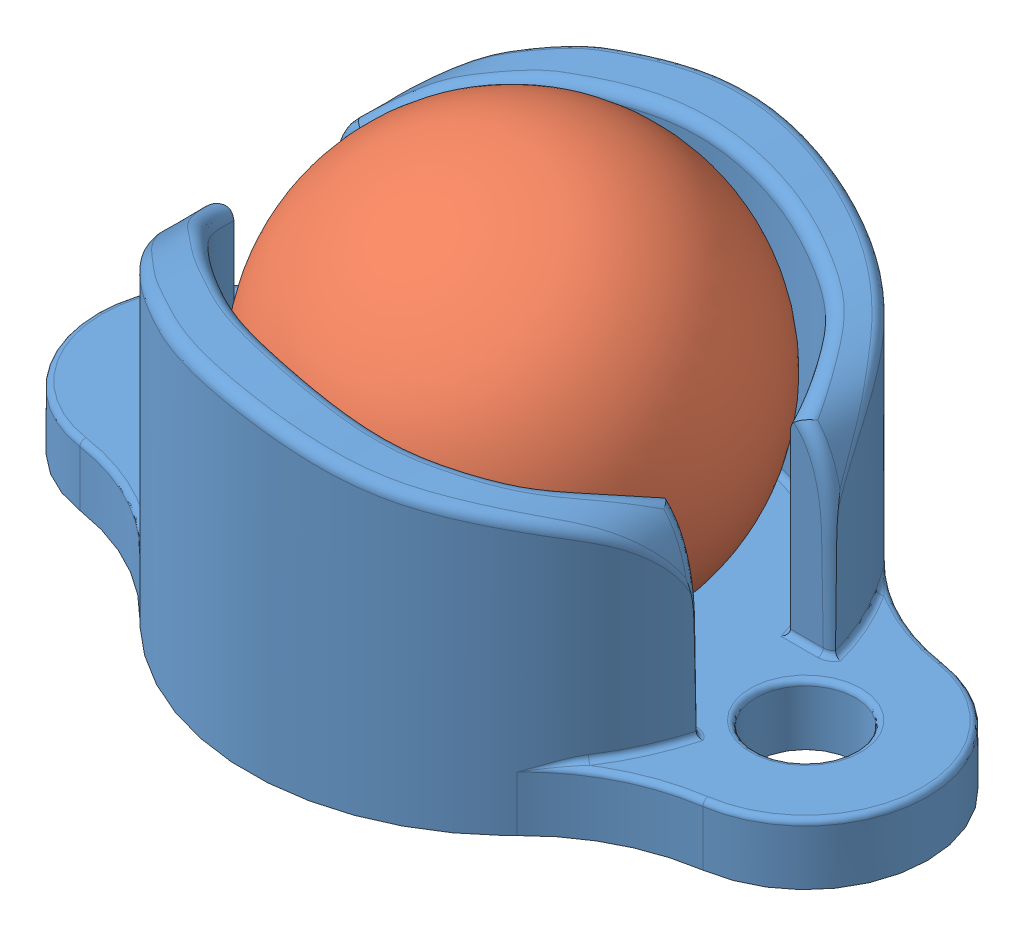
SolidWorks assembly Assemblage1.sldasm, configuration Défaut (file format 11000). Lengths in mm.
Overall size (19.05 9.61 12.25).
2 component instances, 2 part files, 1 mates.
Components (placement in the parent):
- base-1: base.SLDPRT [Predeterminado] at (-0.6925 -1.6208 0) size (19.05 7.74 12.25)
- ball-1: ball.SLDPRT [Predeterminado] at (-0.6925 2.6408 0) size (9.3 9.3 9.3)
Mates (geometry in assembly coordinates):
- Coïncidente1: coincident: circle of base-1; sphere of ball-1
